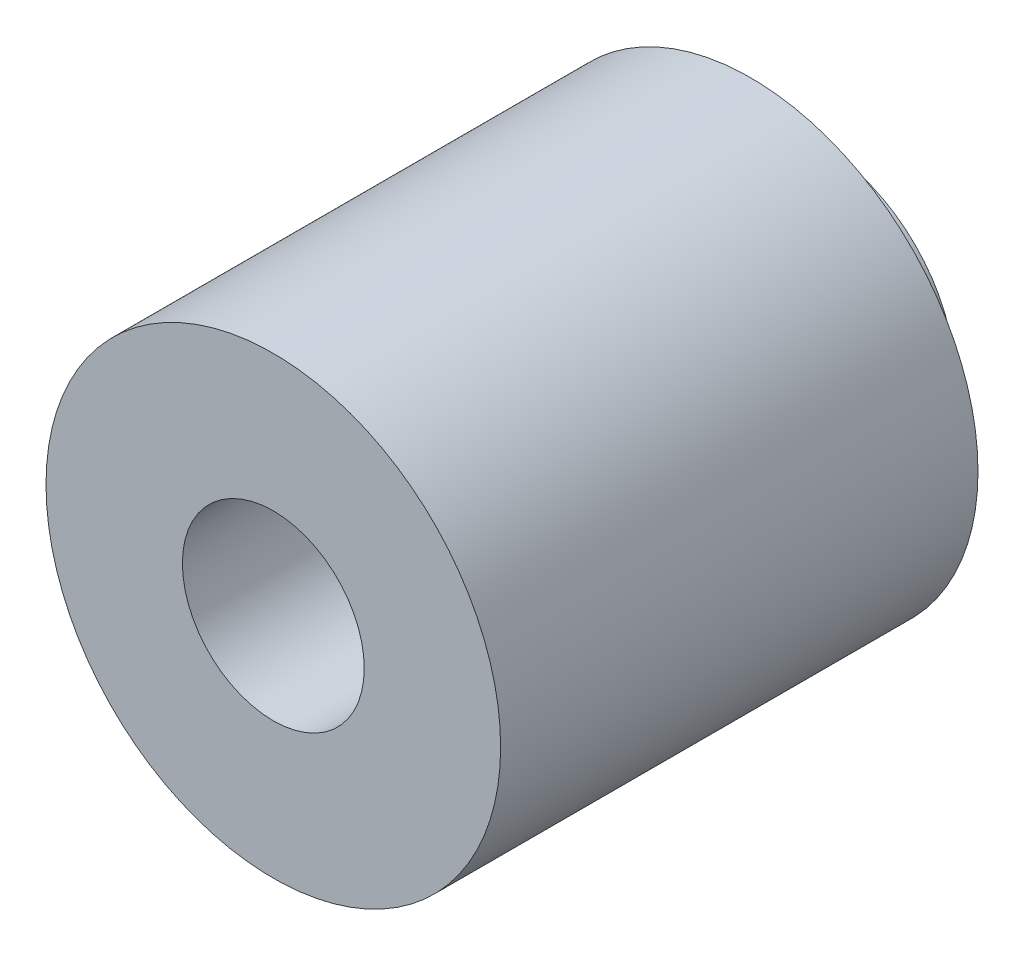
ISO-10303-21;
HEADER;
FILE_DESCRIPTION(('STEP AP214'),'2;1');
FILE_NAME('part.step','',(''),(''),'','','');
FILE_SCHEMA(('AUTOMOTIVE_DESIGN { 1 0 10303 214 1 1 1 1 }'));
ENDSEC;
DATA;
#1=APPLICATION_CONTEXT('core data for automotive mechanical design processes');
#2=APPLICATION_PROTOCOL_DEFINITION('international standard','automotive_design',2000,#1);
#3=PRODUCT_CONTEXT('',#1,'mechanical');
#4=PRODUCT('Part','Part','',(#3));
#5=PRODUCT_RELATED_PRODUCT_CATEGORY('part','',(#4));
#6=PRODUCT_DEFINITION_FORMATION('','',#4);
#7=PRODUCT_DEFINITION_CONTEXT('part definition',#1,'design');
#8=PRODUCT_DEFINITION('design','',#6,#7);
#9=PRODUCT_DEFINITION_SHAPE('','',#8);
#10=(LENGTH_UNIT() NAMED_UNIT(*) SI_UNIT(.MILLI.,.METRE.));
#11=(NAMED_UNIT(*) PLANE_ANGLE_UNIT() SI_UNIT($,.RADIAN.));
#12=(NAMED_UNIT(*) SI_UNIT($,.STERADIAN.) SOLID_ANGLE_UNIT());
#13=UNCERTAINTY_MEASURE_WITH_UNIT(LENGTH_MEASURE(1.E-05),#10,'distance_accuracy_value','');
#14=(GEOMETRIC_REPRESENTATION_CONTEXT(3) GLOBAL_UNCERTAINTY_ASSIGNED_CONTEXT((#13)) GLOBAL_UNIT_ASSIGNED_CONTEXT((#10,
#11,#12)) REPRESENTATION_CONTEXT('',''));
#15=CARTESIAN_POINT('',(0.,0.,0.));
#16=DIRECTION('',(0.,0.,1.));
#17=DIRECTION('',(1.,0.,0.));
#18=AXIS2_PLACEMENT_3D('',#15,#16,#17);
#19=CARTESIAN_POINT('',(0.,0.,32.));
#20=DIRECTION('',(0.,0.,1.));
#21=DIRECTION('',(1.,0.,0.));
#22=AXIS2_PLACEMENT_3D('',#19,#20,#21);
#23=CYLINDRICAL_SURFACE('',#22,5.);
#24=CARTESIAN_POINT('',(0.,0.,12.));
#25=DIRECTION('',(0.,0.,1.));
#26=DIRECTION('',(1.,0.,0.));
#27=AXIS2_PLACEMENT_3D('',#24,#25,#26);
#28=CIRCLE('',#27,5.);
#29=CARTESIAN_POINT('',(5.,0.,12.));
#30=VERTEX_POINT('',#29);
#31=EDGE_CURVE('E8',#30,#30,#28,.T.);
#32=ORIENTED_EDGE('',*,*,#31,.F.);
#33=EDGE_LOOP('',(#32));
#34=FACE_BOUND('',#33,.T.);
#35=CARTESIAN_POINT('',(0.,0.,1.5));
#36=DIRECTION('',(0.,0.,-1.));
#37=DIRECTION('',(-1.,0.,0.));
#38=AXIS2_PLACEMENT_3D('',#35,#36,#37);
#39=CIRCLE('',#38,5.);
#40=CARTESIAN_POINT('',(-5.,0.,1.5));
#41=VERTEX_POINT('',#40);
#42=EDGE_CURVE('E28',#41,#41,#39,.F.);
#43=ORIENTED_EDGE('',*,*,#42,.T.);
#44=EDGE_LOOP('',(#43));
#45=FACE_BOUND('',#44,.T.);
#46=ADVANCED_FACE('F12',(#34,#45),#23,.T.);
#47=CARTESIAN_POINT('',(0.,0.,12.));
#48=DIRECTION('',(0.,0.,1.));
#49=DIRECTION('',(1.,0.,0.));
#50=AXIS2_PLACEMENT_3D('',#47,#48,#49);
#51=PLANE('',#50);
#52=ORIENTED_EDGE('',*,*,#31,.T.);
#53=EDGE_LOOP('',(#52));
#54=FACE_BOUND('',#53,.T.);
#55=CARTESIAN_POINT('',(0.,0.,12.));
#56=DIRECTION('',(0.,0.,-1.));
#57=DIRECTION('',(-1.,0.,0.));
#58=AXIS2_PLACEMENT_3D('',#55,#56,#57);
#59=CIRCLE('',#58,2.);
#60=CARTESIAN_POINT('',(-2.,0.,12.));
#61=VERTEX_POINT('',#60);
#62=EDGE_CURVE('E25',#61,#61,#59,.T.);
#63=ORIENTED_EDGE('',*,*,#62,.T.);
#64=EDGE_LOOP('',(#63));
#65=FACE_BOUND('',#64,.T.);
#66=ADVANCED_FACE('F41',(#54,#65),#51,.T.);
#67=CARTESIAN_POINT('',(0.,0.,8.5));
#68=DIRECTION('',(0.,0.,1.));
#69=DIRECTION('',(1.,0.,0.));
#70=AXIS2_PLACEMENT_3D('',#67,#68,#69);
#71=CYLINDRICAL_SURFACE('',#70,2.);
#72=CARTESIAN_POINT('',(0.,0.,8.5));
#73=DIRECTION('',(0.,0.,-1.));
#74=DIRECTION('',(-1.,0.,0.));
#75=AXIS2_PLACEMENT_3D('',#72,#73,#74);
#76=CIRCLE('',#75,2.);
#77=CARTESIAN_POINT('',(-2.,0.,8.5));
#78=VERTEX_POINT('',#77);
#79=EDGE_CURVE('E20',#78,#78,#76,.T.);
#80=ORIENTED_EDGE('',*,*,#79,.T.);
#81=EDGE_LOOP('',(#80));
#82=FACE_BOUND('',#81,.T.);
#83=ORIENTED_EDGE('',*,*,#62,.F.);
#84=EDGE_LOOP('',(#83));
#85=FACE_BOUND('',#84,.T.);
#86=ADVANCED_FACE('F43',(#82,#85),#71,.F.);
#87=CARTESIAN_POINT('',(0.,0.,8.5));
#88=DIRECTION('',(0.,0.,-1.));
#89=DIRECTION('',(-1.,0.,0.));
#90=AXIS2_PLACEMENT_3D('',#87,#88,#89);
#91=PLANE('',#90);
#92=ORIENTED_EDGE('',*,*,#79,.F.);
#93=EDGE_LOOP('',(#92));
#94=FACE_BOUND('',#93,.T.);
#95=ADVANCED_FACE('F45',(#94),#91,.F.);
#96=CARTESIAN_POINT('',(0.,0.,-28.));
#97=DIRECTION('',(0.,0.,-1.));
#98=DIRECTION('',(-1.,0.,0.));
#99=AXIS2_PLACEMENT_3D('',#96,#97,#98);
#100=CYLINDRICAL_SURFACE('',#99,3.);
#101=CARTESIAN_POINT('',(0.,0.,0.));
#102=DIRECTION('',(0.,0.,-1.));
#103=DIRECTION('',(-1.,0.,0.));
#104=AXIS2_PLACEMENT_3D('',#101,#102,#103);
#105=CIRCLE('',#104,3.);
#106=CARTESIAN_POINT('',(-3.,0.,0.));
#107=VERTEX_POINT('',#106);
#108=EDGE_CURVE('E16',#107,#107,#105,.F.);
#109=ORIENTED_EDGE('',*,*,#108,.T.);
#110=EDGE_LOOP('',(#109));
#111=FACE_BOUND('',#110,.T.);
#112=CARTESIAN_POINT('',(0.,0.,1.5));
#113=DIRECTION('',(0.,0.,-1.));
#114=DIRECTION('',(-1.,0.,0.));
#115=AXIS2_PLACEMENT_3D('',#112,#113,#114);
#116=CIRCLE('',#115,3.);
#117=CARTESIAN_POINT('',(-3.,0.,1.5));
#118=VERTEX_POINT('',#117);
#119=EDGE_CURVE('E30',#118,#118,#116,.T.);
#120=ORIENTED_EDGE('',*,*,#119,.T.);
#121=EDGE_LOOP('',(#120));
#122=FACE_BOUND('',#121,.T.);
#123=ADVANCED_FACE('F48',(#111,#122),#100,.T.);
#124=CARTESIAN_POINT('',(0.,3.,1.5));
#125=DIRECTION('',(0.,0.,-1.));
#126=DIRECTION('',(-1.,0.,0.));
#127=AXIS2_PLACEMENT_3D('',#124,#125,#126);
#128=PLANE('',#127);
#129=ORIENTED_EDGE('',*,*,#42,.F.);
#130=EDGE_LOOP('',(#129));
#131=FACE_BOUND('',#130,.T.);
#132=ORIENTED_EDGE('',*,*,#119,.F.);
#133=EDGE_LOOP('',(#132));
#134=FACE_BOUND('',#133,.T.);
#135=ADVANCED_FACE('F58',(#131,#134),#128,.T.);
#136=CARTESIAN_POINT('',(5.,0.,0.));
#137=DIRECTION('',(0.,0.,-1.));
#138=DIRECTION('',(-1.,0.,0.));
#139=AXIS2_PLACEMENT_3D('',#136,#137,#138);
#140=PLANE('',#139);
#141=ORIENTED_EDGE('',*,*,#108,.F.);
#142=EDGE_LOOP('',(#141));
#143=FACE_BOUND('',#142,.T.);
#144=ADVANCED_FACE('F14',(#143),#140,.T.);
#145=CLOSED_SHELL('',(#46,#66,#86,#95,#123,#135,#144));
#146=MANIFOLD_SOLID_BREP('B1',#145);
#147=ADVANCED_BREP_SHAPE_REPRESENTATION('',(#18,#146),#14);
#148=SHAPE_DEFINITION_REPRESENTATION(#9,#147);
ENDSEC;
END-ISO-10303-21;
